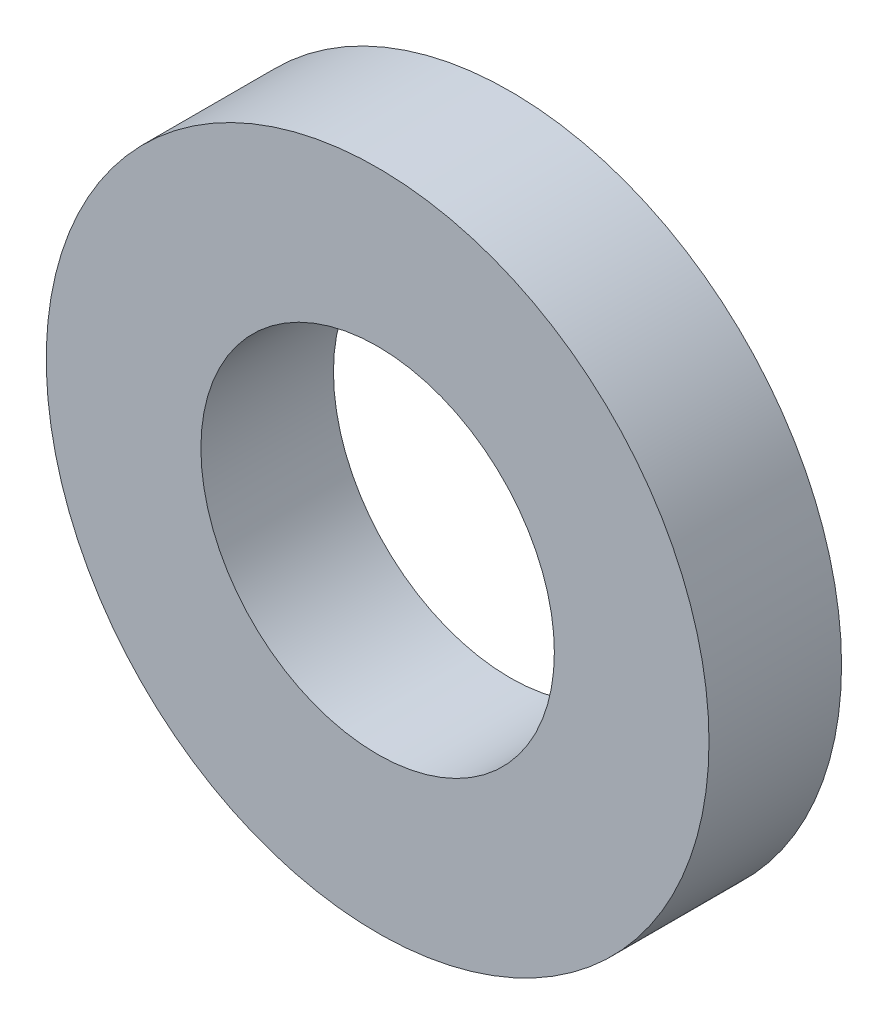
from build123d import *

# Parameters (mm, degrees)
CROQUIS1_R              = 7.5
CROQUIS1_R_2            = 4
SALIENTE_EXTRUIR1_DEPTH = 1.5


with BuildPart() as part:
    # Croquis1 → Saliente-Extruir1 (new, symmetric)
    with BuildSketch(Plane.XY):
        Circle(CROQUIS1_R)
        Circle(CROQUIS1_R_2, mode=Mode.SUBTRACT)
    extrude(amount=SALIENTE_EXTRUIR1_DEPTH, both=True)


solid = part.part
